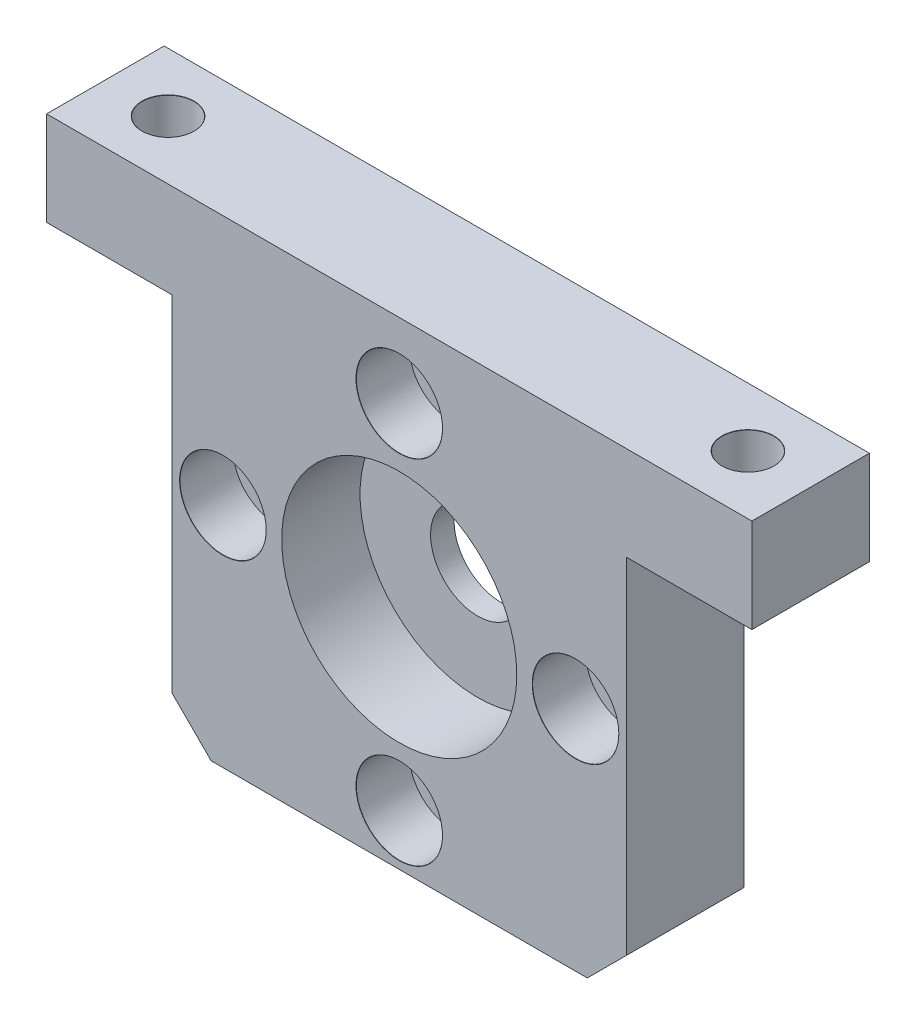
ISO-10303-21;
HEADER;
FILE_DESCRIPTION(('STEP AP214'),'2;1');
FILE_NAME('part.step','',(''),(''),'','','');
FILE_SCHEMA(('AUTOMOTIVE_DESIGN { 1 0 10303 214 1 1 1 1 }'));
ENDSEC;
DATA;
#1=APPLICATION_CONTEXT('core data for automotive mechanical design processes');
#2=APPLICATION_PROTOCOL_DEFINITION('international standard','automotive_design',2000,#1);
#3=PRODUCT_CONTEXT('',#1,'mechanical');
#4=PRODUCT('Part','Part','',(#3));
#5=PRODUCT_RELATED_PRODUCT_CATEGORY('part','',(#4));
#6=PRODUCT_DEFINITION_FORMATION('','',#4);
#7=PRODUCT_DEFINITION_CONTEXT('part definition',#1,'design');
#8=PRODUCT_DEFINITION('design','',#6,#7);
#9=PRODUCT_DEFINITION_SHAPE('','',#8);
#10=(LENGTH_UNIT() NAMED_UNIT(*) SI_UNIT(.MILLI.,.METRE.));
#11=(NAMED_UNIT(*) PLANE_ANGLE_UNIT() SI_UNIT($,.RADIAN.));
#12=(NAMED_UNIT(*) SI_UNIT($,.STERADIAN.) SOLID_ANGLE_UNIT());
#13=UNCERTAINTY_MEASURE_WITH_UNIT(LENGTH_MEASURE(1.E-05),#10,'distance_accuracy_value','');
#14=(GEOMETRIC_REPRESENTATION_CONTEXT(3) GLOBAL_UNCERTAINTY_ASSIGNED_CONTEXT((#13)) GLOBAL_UNIT_ASSIGNED_CONTEXT((#10,
#11,#12)) REPRESENTATION_CONTEXT('',''));
#15=CARTESIAN_POINT('',(0.,0.,0.));
#16=DIRECTION('',(0.,0.,1.));
#17=DIRECTION('',(1.,0.,0.));
#18=AXIS2_PLACEMENT_3D('',#15,#16,#17);
#19=CARTESIAN_POINT('',(-27.5119279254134,-20.6542028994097,0.));
#20=DIRECTION('',(0.,0.,1.));
#21=DIRECTION('',(1.,0.,0.));
#22=AXIS2_PLACEMENT_3D('',#19,#20,#21);
#23=CYLINDRICAL_SURFACE('',#22,6.);
#24=CARTESIAN_POINT('',(-27.5119279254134,-20.6542028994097,5.));
#25=DIRECTION('',(0.,0.,1.));
#26=DIRECTION('',(1.,0.,0.));
#27=AXIS2_PLACEMENT_3D('',#24,#25,#26);
#28=CIRCLE('',#27,6.);
#29=CARTESIAN_POINT('',(-21.5119279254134,-20.6542028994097,5.));
#30=VERTEX_POINT('',#29);
#31=EDGE_CURVE('E254',#30,#30,#28,.T.);
#32=ORIENTED_EDGE('',*,*,#31,.T.);
#33=EDGE_LOOP('',(#32));
#34=FACE_BOUND('',#33,.T.);
#35=CARTESIAN_POINT('',(-27.5119279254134,-20.6542028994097,2.));
#36=DIRECTION('',(0.,0.,-1.));
#37=DIRECTION('',(-1.,0.,0.));
#38=AXIS2_PLACEMENT_3D('',#35,#36,#37);
#39=CIRCLE('',#38,6.);
#40=CARTESIAN_POINT('',(-33.5119279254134,-20.6542028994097,2.));
#41=VERTEX_POINT('',#40);
#42=EDGE_CURVE('E251',#41,#41,#39,.F.);
#43=ORIENTED_EDGE('',*,*,#42,.F.);
#44=EDGE_LOOP('',(#43));
#45=FACE_BOUND('',#44,.T.);
#46=ADVANCED_FACE('F16',(#34,#45),#23,.F.);
#47=CARTESIAN_POINT('',(-72.5119279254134,11.3457971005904,15.));
#48=DIRECTION('',(1.,0.,0.));
#49=DIRECTION('',(0.,0.,-1.));
#50=AXIS2_PLACEMENT_3D('',#47,#48,#49);
#51=PLANE('',#50);
#52=DIRECTION('',(0.,-1.,0.));
#53=VECTOR('',#52,1.);
#54=CARTESIAN_POINT('',(-72.5119279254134,11.3457971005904,0.));
#55=LINE('',#54,#53);
#56=CARTESIAN_POINT('',(-72.5119279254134,11.3457971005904,0.));
#57=VERTEX_POINT('',#56);
#58=CARTESIAN_POINT('',(-72.5119279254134,-0.654202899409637,0.));
#59=VERTEX_POINT('',#58);
#60=EDGE_CURVE('E261',#57,#59,#55,.T.);
#61=ORIENTED_EDGE('',*,*,#60,.T.);
#62=DIRECTION('',(0.,0.,-1.));
#63=VECTOR('',#62,1.);
#64=CARTESIAN_POINT('',(-72.5119279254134,-0.654202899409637,15.));
#65=LINE('',#64,#63);
#66=CARTESIAN_POINT('',(-72.5119279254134,-0.654202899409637,15.));
#67=VERTEX_POINT('',#66);
#68=EDGE_CURVE('E313',#67,#59,#65,.T.);
#69=ORIENTED_EDGE('',*,*,#68,.F.);
#70=DIRECTION('',(0.,-1.,0.));
#71=VECTOR('',#70,1.);
#72=CARTESIAN_POINT('',(-72.5119279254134,11.3457971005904,15.));
#73=LINE('',#72,#71);
#74=CARTESIAN_POINT('',(-72.5119279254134,11.3457971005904,15.));
#75=VERTEX_POINT('',#74);
#76=EDGE_CURVE('E264',#75,#67,#73,.T.);
#77=ORIENTED_EDGE('',*,*,#76,.F.);
#78=DIRECTION('',(0.,0.,-1.));
#79=VECTOR('',#78,1.);
#80=CARTESIAN_POINT('',(-72.5119279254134,11.3457971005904,15.));
#81=LINE('',#80,#79);
#82=EDGE_CURVE('E282',#75,#57,#81,.T.);
#83=ORIENTED_EDGE('',*,*,#82,.T.);
#84=EDGE_LOOP('',(#61,#69,#77,#83));
#85=FACE_BOUND('',#84,.T.);
#86=ADVANCED_FACE('F350',(#85),#51,.F.);
#87=CARTESIAN_POINT('',(-72.5119279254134,-0.654202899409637,15.));
#88=DIRECTION('',(0.,1.,0.));
#89=DIRECTION('',(0.,0.,1.));
#90=AXIS2_PLACEMENT_3D('',#87,#88,#89);
#91=PLANE('',#90);
#92=CARTESIAN_POINT('',(-64.5119279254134,-0.654202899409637,7.5));
#93=DIRECTION('',(0.,-1.,0.));
#94=DIRECTION('',(0.,0.,-1.));
#95=AXIS2_PLACEMENT_3D('',#92,#93,#94);
#96=CIRCLE('',#95,5.525);
#97=CARTESIAN_POINT('',(-64.5119279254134,-0.654202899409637,1.975));
#98=VERTEX_POINT('',#97);
#99=EDGE_CURVE('E145',#98,#98,#96,.T.);
#100=ORIENTED_EDGE('',*,*,#99,.F.);
#101=EDGE_LOOP('',(#100));
#102=FACE_BOUND('',#101,.T.);
#103=DIRECTION('',(1.,0.,0.));
#104=VECTOR('',#103,1.);
#105=CARTESIAN_POINT('',(-72.5119279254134,-0.654202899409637,0.));
#106=LINE('',#105,#104);
#107=CARTESIAN_POINT('',(-56.5119279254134,-0.654202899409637,0.));
#108=VERTEX_POINT('',#107);
#109=EDGE_CURVE('E285',#59,#108,#106,.T.);
#110=ORIENTED_EDGE('',*,*,#109,.T.);
#111=DIRECTION('',(0.,0.,-1.));
#112=VECTOR('',#111,1.);
#113=CARTESIAN_POINT('',(-56.5119279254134,-0.654202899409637,15.));
#114=LINE('',#113,#112);
#115=CARTESIAN_POINT('',(-56.5119279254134,-0.654202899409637,15.));
#116=VERTEX_POINT('',#115);
#117=EDGE_CURVE('E310',#116,#108,#114,.T.);
#118=ORIENTED_EDGE('',*,*,#117,.F.);
#119=DIRECTION('',(1.,0.,0.));
#120=VECTOR('',#119,1.);
#121=CARTESIAN_POINT('',(-72.5119279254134,-0.654202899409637,15.));
#122=LINE('',#121,#120);
#123=EDGE_CURVE('E267',#67,#116,#122,.T.);
#124=ORIENTED_EDGE('',*,*,#123,.F.);
#125=ORIENTED_EDGE('',*,*,#68,.T.);
#126=EDGE_LOOP('',(#110,#118,#124,#125));
#127=FACE_BOUND('',#126,.T.);
#128=ADVANCED_FACE('F344',(#102,#127),#91,.F.);
#129=CARTESIAN_POINT('',(-56.5119279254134,-0.654202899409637,15.));
#130=DIRECTION('',(1.,0.,0.));
#131=DIRECTION('',(0.,1.,0.));
#132=AXIS2_PLACEMENT_3D('',#129,#130,#131);
#133=PLANE('',#132);
#134=CARTESIAN_POINT('',(-56.5119279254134,-29.6542028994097,7.5));
#135=DIRECTION('',(-1.,0.,0.));
#136=DIRECTION('',(0.,0.,1.));
#137=AXIS2_PLACEMENT_3D('',#134,#135,#136);
#138=CIRCLE('',#137,1.24999999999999);
#139=CARTESIAN_POINT('',(-56.5119279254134,-29.6542028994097,8.74999999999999));
#140=VERTEX_POINT('',#139);
#141=EDGE_CURVE('E111',#140,#140,#138,.T.);
#142=ORIENTED_EDGE('',*,*,#141,.F.);
#143=EDGE_LOOP('',(#142));
#144=FACE_BOUND('',#143,.T.);
#145=CARTESIAN_POINT('',(-56.5119279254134,-13.6542028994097,7.5));
#146=DIRECTION('',(-1.,0.,0.));
#147=DIRECTION('',(0.,0.,1.));
#148=AXIS2_PLACEMENT_3D('',#145,#146,#147);
#149=CIRCLE('',#148,1.25);
#150=CARTESIAN_POINT('',(-56.5119279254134,-13.6542028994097,8.75));
#151=VERTEX_POINT('',#150);
#152=EDGE_CURVE('E110',#151,#151,#149,.T.);
#153=ORIENTED_EDGE('',*,*,#152,.F.);
#154=EDGE_LOOP('',(#153));
#155=FACE_BOUND('',#154,.T.);
#156=DIRECTION('',(0.,-1.,0.));
#157=VECTOR('',#156,1.);
#158=CARTESIAN_POINT('',(-56.5119279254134,-0.654202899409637,0.));
#159=LINE('',#158,#157);
#160=CARTESIAN_POINT('',(-56.5119279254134,-44.6542028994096,0.));
#161=VERTEX_POINT('',#160);
#162=EDGE_CURVE('E287',#108,#161,#159,.T.);
#163=ORIENTED_EDGE('',*,*,#162,.T.);
#164=DIRECTION('',(0.,0.,1.));
#165=VECTOR('',#164,1.);
#166=CARTESIAN_POINT('',(-56.5119279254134,-44.6542028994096,15.));
#167=LINE('',#166,#165);
#168=CARTESIAN_POINT('',(-56.5119279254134,-44.6542028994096,15.));
#169=VERTEX_POINT('',#168);
#170=EDGE_CURVE('E39',#161,#169,#167,.T.);
#171=ORIENTED_EDGE('',*,*,#170,.T.);
#172=DIRECTION('',(0.,-1.,0.));
#173=VECTOR('',#172,1.);
#174=CARTESIAN_POINT('',(-56.5119279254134,-0.654202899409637,15.));
#175=LINE('',#174,#173);
#176=EDGE_CURVE('E270',#116,#169,#175,.T.);
#177=ORIENTED_EDGE('',*,*,#176,.F.);
#178=ORIENTED_EDGE('',*,*,#117,.T.);
#179=EDGE_LOOP('',(#163,#171,#177,#178));
#180=FACE_BOUND('',#179,.T.);
#181=ADVANCED_FACE('F341',(#144,#155,#180),#133,.F.);
#182=CARTESIAN_POINT('',(-56.5119279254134,-49.6542028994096,15.));
#183=DIRECTION('',(0.,1.,0.));
#184=DIRECTION('',(0.,0.,1.));
#185=AXIS2_PLACEMENT_3D('',#182,#183,#184);
#186=PLANE('',#185);
#187=DIRECTION('',(1.,0.,0.));
#188=VECTOR('',#187,1.);
#189=CARTESIAN_POINT('',(-56.5119279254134,-49.6542028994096,15.));
#190=LINE('',#189,#188);
#191=CARTESIAN_POINT('',(-51.5119279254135,-49.6542028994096,15.));
#192=VERTEX_POINT('',#191);
#193=CARTESIAN_POINT('',(-3.51192792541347,-49.6542028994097,15.));
#194=VERTEX_POINT('',#193);
#195=EDGE_CURVE('E272',#192,#194,#190,.T.);
#196=ORIENTED_EDGE('',*,*,#195,.F.);
#197=DIRECTION('',(0.,0.,-1.));
#198=VECTOR('',#197,1.);
#199=CARTESIAN_POINT('',(-51.5119279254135,-49.6542028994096,15.));
#200=LINE('',#199,#198);
#201=CARTESIAN_POINT('',(-51.5119279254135,-49.6542028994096,0.));
#202=VERTEX_POINT('',#201);
#203=EDGE_CURVE('E320',#192,#202,#200,.T.);
#204=ORIENTED_EDGE('',*,*,#203,.T.);
#205=DIRECTION('',(1.,0.,0.));
#206=VECTOR('',#205,1.);
#207=CARTESIAN_POINT('',(-56.5119279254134,-49.6542028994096,0.));
#208=LINE('',#207,#206);
#209=CARTESIAN_POINT('',(-3.51192792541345,-49.6542028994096,0.));
#210=VERTEX_POINT('',#209);
#211=EDGE_CURVE('E289',#202,#210,#208,.T.);
#212=ORIENTED_EDGE('',*,*,#211,.T.);
#213=DIRECTION('',(0.,0.,1.));
#214=VECTOR('',#213,1.);
#215=CARTESIAN_POINT('',(-3.51192792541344,-49.6542028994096,15.));
#216=LINE('',#215,#214);
#217=EDGE_CURVE('E316',#210,#194,#216,.T.);
#218=ORIENTED_EDGE('',*,*,#217,.T.);
#219=EDGE_LOOP('',(#196,#204,#212,#218));
#220=FACE_BOUND('',#219,.T.);
#221=ADVANCED_FACE('F334',(#220),#186,.F.);
#222=CARTESIAN_POINT('',(1.48807207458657,-0.654202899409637,15.));
#223=DIRECTION('',(-1.,0.,0.));
#224=DIRECTION('',(0.,-1.,0.));
#225=AXIS2_PLACEMENT_3D('',#222,#223,#224);
#226=PLANE('',#225);
#227=DIRECTION('',(0.,1.,0.));
#228=VECTOR('',#227,1.);
#229=CARTESIAN_POINT('',(1.48807207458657,-0.654202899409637,15.));
#230=LINE('',#229,#228);
#231=CARTESIAN_POINT('',(1.48807207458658,-44.6542028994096,15.));
#232=VERTEX_POINT('',#231);
#233=CARTESIAN_POINT('',(1.48807207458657,-0.654202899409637,15.));
#234=VERTEX_POINT('',#233);
#235=EDGE_CURVE('E274',#232,#234,#230,.T.);
#236=ORIENTED_EDGE('',*,*,#235,.F.);
#237=DIRECTION('',(0.,0.,-1.));
#238=VECTOR('',#237,1.);
#239=CARTESIAN_POINT('',(1.48807207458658,-44.6542028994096,15.));
#240=LINE('',#239,#238);
#241=CARTESIAN_POINT('',(1.48807207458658,-44.6542028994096,0.));
#242=VERTEX_POINT('',#241);
#243=EDGE_CURVE('E11',#232,#242,#240,.T.);
#244=ORIENTED_EDGE('',*,*,#243,.T.);
#245=DIRECTION('',(0.,1.,0.));
#246=VECTOR('',#245,1.);
#247=CARTESIAN_POINT('',(1.48807207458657,-0.654202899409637,0.));
#248=LINE('',#247,#246);
#249=CARTESIAN_POINT('',(1.48807207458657,-0.654202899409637,0.));
#250=VERTEX_POINT('',#249);
#251=EDGE_CURVE('E292',#242,#250,#248,.T.);
#252=ORIENTED_EDGE('',*,*,#251,.T.);
#253=DIRECTION('',(0.,0.,-1.));
#254=VECTOR('',#253,1.);
#255=CARTESIAN_POINT('',(1.48807207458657,-0.654202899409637,15.));
#256=LINE('',#255,#254);
#257=EDGE_CURVE('E307',#234,#250,#256,.T.);
#258=ORIENTED_EDGE('',*,*,#257,.F.);
#259=EDGE_LOOP('',(#236,#244,#252,#258));
#260=FACE_BOUND('',#259,.T.);
#261=ADVANCED_FACE('F368',(#260),#226,.F.);
#262=CARTESIAN_POINT('',(1.48807207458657,-0.654202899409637,15.));
#263=DIRECTION('',(0.,1.,0.));
#264=DIRECTION('',(0.,0.,1.));
#265=AXIS2_PLACEMENT_3D('',#262,#263,#264);
#266=PLANE('',#265);
#267=CARTESIAN_POINT('',(9.48807207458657,-0.654202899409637,7.5));
#268=DIRECTION('',(0.,-1.,0.));
#269=DIRECTION('',(0.,0.,-1.));
#270=AXIS2_PLACEMENT_3D('',#267,#268,#269);
#271=CIRCLE('',#270,5.525);
#272=CARTESIAN_POINT('',(9.48807207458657,-0.654202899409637,1.975));
#273=VERTEX_POINT('',#272);
#274=EDGE_CURVE('E124',#273,#273,#271,.T.);
#275=ORIENTED_EDGE('',*,*,#274,.F.);
#276=EDGE_LOOP('',(#275));
#277=FACE_BOUND('',#276,.T.);
#278=DIRECTION('',(1.,0.,0.));
#279=VECTOR('',#278,1.);
#280=CARTESIAN_POINT('',(1.48807207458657,-0.654202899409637,0.));
#281=LINE('',#280,#279);
#282=CARTESIAN_POINT('',(17.4880720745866,-0.654202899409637,0.));
#283=VERTEX_POINT('',#282);
#284=EDGE_CURVE('E294',#250,#283,#281,.T.);
#285=ORIENTED_EDGE('',*,*,#284,.T.);
#286=DIRECTION('',(0.,0.,-1.));
#287=VECTOR('',#286,1.);
#288=CARTESIAN_POINT('',(17.4880720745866,-0.654202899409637,15.));
#289=LINE('',#288,#287);
#290=CARTESIAN_POINT('',(17.4880720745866,-0.654202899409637,15.));
#291=VERTEX_POINT('',#290);
#292=EDGE_CURVE('E304',#291,#283,#289,.T.);
#293=ORIENTED_EDGE('',*,*,#292,.F.);
#294=DIRECTION('',(1.,0.,0.));
#295=VECTOR('',#294,1.);
#296=CARTESIAN_POINT('',(1.48807207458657,-0.654202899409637,15.));
#297=LINE('',#296,#295);
#298=EDGE_CURVE('E276',#234,#291,#297,.T.);
#299=ORIENTED_EDGE('',*,*,#298,.F.);
#300=ORIENTED_EDGE('',*,*,#257,.T.);
#301=EDGE_LOOP('',(#285,#293,#299,#300));
#302=FACE_BOUND('',#301,.T.);
#303=ADVANCED_FACE('F364',(#277,#302),#266,.F.);
#304=CARTESIAN_POINT('',(17.4880720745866,11.3457971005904,15.));
#305=DIRECTION('',(-1.,0.,0.));
#306=DIRECTION('',(0.,-1.,0.));
#307=AXIS2_PLACEMENT_3D('',#304,#305,#306);
#308=PLANE('',#307);
#309=DIRECTION('',(0.,1.,0.));
#310=VECTOR('',#309,1.);
#311=CARTESIAN_POINT('',(17.4880720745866,11.3457971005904,0.));
#312=LINE('',#311,#310);
#313=CARTESIAN_POINT('',(17.4880720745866,11.3457971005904,0.));
#314=VERTEX_POINT('',#313);
#315=EDGE_CURVE('E296',#283,#314,#312,.T.);
#316=ORIENTED_EDGE('',*,*,#315,.T.);
#317=DIRECTION('',(0.,0.,-1.));
#318=VECTOR('',#317,1.);
#319=CARTESIAN_POINT('',(17.4880720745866,11.3457971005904,15.));
#320=LINE('',#319,#318);
#321=CARTESIAN_POINT('',(17.4880720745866,11.3457971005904,15.));
#322=VERTEX_POINT('',#321);
#323=EDGE_CURVE('E301',#322,#314,#320,.T.);
#324=ORIENTED_EDGE('',*,*,#323,.F.);
#325=DIRECTION('',(0.,1.,0.));
#326=VECTOR('',#325,1.);
#327=CARTESIAN_POINT('',(17.4880720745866,11.3457971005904,15.));
#328=LINE('',#327,#326);
#329=EDGE_CURVE('E278',#291,#322,#328,.T.);
#330=ORIENTED_EDGE('',*,*,#329,.F.);
#331=ORIENTED_EDGE('',*,*,#292,.T.);
#332=EDGE_LOOP('',(#316,#324,#330,#331));
#333=FACE_BOUND('',#332,.T.);
#334=ADVANCED_FACE('F359',(#333),#308,.F.);
#335=CARTESIAN_POINT('',(-72.5119279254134,11.3457971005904,15.));
#336=DIRECTION('',(0.,-1.,0.));
#337=DIRECTION('',(0.,0.,-1.));
#338=AXIS2_PLACEMENT_3D('',#335,#336,#337);
#339=PLANE('',#338);
#340=CARTESIAN_POINT('',(9.48807207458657,11.3457971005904,7.5));
#341=DIRECTION('',(0.,-1.,0.));
#342=DIRECTION('',(0.,0.,-1.));
#343=AXIS2_PLACEMENT_3D('',#340,#341,#342);
#344=CIRCLE('',#343,3.325);
#345=CARTESIAN_POINT('',(9.48807207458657,11.3457971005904,4.175));
#346=VERTEX_POINT('',#345);
#347=EDGE_CURVE('E121',#346,#346,#344,.T.);
#348=ORIENTED_EDGE('',*,*,#347,.T.);
#349=EDGE_LOOP('',(#348));
#350=FACE_BOUND('',#349,.T.);
#351=CARTESIAN_POINT('',(-64.5119279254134,11.3457971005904,7.5));
#352=DIRECTION('',(0.,-1.,0.));
#353=DIRECTION('',(0.,0.,-1.));
#354=AXIS2_PLACEMENT_3D('',#351,#352,#353);
#355=CIRCLE('',#354,3.325);
#356=CARTESIAN_POINT('',(-64.5119279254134,11.3457971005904,4.175));
#357=VERTEX_POINT('',#356);
#358=EDGE_CURVE('E142',#357,#357,#355,.T.);
#359=ORIENTED_EDGE('',*,*,#358,.T.);
#360=EDGE_LOOP('',(#359));
#361=FACE_BOUND('',#360,.T.);
#362=DIRECTION('',(-1.,0.,0.));
#363=VECTOR('',#362,1.);
#364=CARTESIAN_POINT('',(-72.5119279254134,11.3457971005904,0.));
#365=LINE('',#364,#363);
#366=EDGE_CURVE('E268',#314,#57,#365,.T.);
#367=ORIENTED_EDGE('',*,*,#366,.T.);
#368=ORIENTED_EDGE('',*,*,#82,.F.);
#369=DIRECTION('',(-1.,0.,0.));
#370=VECTOR('',#369,1.);
#371=CARTESIAN_POINT('',(-72.5119279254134,11.3457971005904,15.));
#372=LINE('',#371,#370);
#373=EDGE_CURVE('E280',#322,#75,#372,.T.);
#374=ORIENTED_EDGE('',*,*,#373,.F.);
#375=ORIENTED_EDGE('',*,*,#323,.T.);
#376=EDGE_LOOP('',(#367,#368,#374,#375));
#377=FACE_BOUND('',#376,.T.);
#378=ADVANCED_FACE('F355',(#350,#361,#377),#339,.F.);
#379=CARTESIAN_POINT('',(0.,0.,15.));
#380=DIRECTION('',(0.,0.,1.));
#381=DIRECTION('',(1.,0.,0.));
#382=AXIS2_PLACEMENT_3D('',#379,#380,#381);
#383=PLANE('',#382);
#384=CARTESIAN_POINT('',(-27.5119279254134,-43.1542028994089,15.));
#385=DIRECTION('',(0.,0.,1.));
#386=DIRECTION('',(1.,0.,0.));
#387=AXIS2_PLACEMENT_3D('',#384,#385,#386);
#388=CIRCLE('',#387,5.525);
#389=CARTESIAN_POINT('',(-21.9869279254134,-43.1542028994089,15.));
#390=VERTEX_POINT('',#389);
#391=EDGE_CURVE('E166',#390,#390,#388,.T.);
#392=ORIENTED_EDGE('',*,*,#391,.F.);
#393=EDGE_LOOP('',(#392));
#394=FACE_BOUND('',#393,.T.);
#395=CARTESIAN_POINT('',(-50.0119279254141,-20.6542028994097,15.));
#396=DIRECTION('',(0.,0.,1.));
#397=DIRECTION('',(1.,0.,0.));
#398=AXIS2_PLACEMENT_3D('',#395,#396,#397);
#399=CIRCLE('',#398,5.525);
#400=CARTESIAN_POINT('',(-44.4869279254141,-20.6542028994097,15.));
#401=VERTEX_POINT('',#400);
#402=EDGE_CURVE('E187',#401,#401,#399,.T.);
#403=ORIENTED_EDGE('',*,*,#402,.F.);
#404=EDGE_LOOP('',(#403));
#405=FACE_BOUND('',#404,.T.);
#406=CARTESIAN_POINT('',(-27.5119279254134,1.84579710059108,15.));
#407=DIRECTION('',(0.,0.,1.));
#408=DIRECTION('',(1.,0.,0.));
#409=AXIS2_PLACEMENT_3D('',#406,#407,#408);
#410=CIRCLE('',#409,5.525);
#411=CARTESIAN_POINT('',(-21.9869279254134,1.84579710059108,15.));
#412=VERTEX_POINT('',#411);
#413=EDGE_CURVE('E208',#412,#412,#410,.T.);
#414=ORIENTED_EDGE('',*,*,#413,.F.);
#415=EDGE_LOOP('',(#414));
#416=FACE_BOUND('',#415,.T.);
#417=CARTESIAN_POINT('',(-5.01192792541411,-20.6542028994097,15.));
#418=DIRECTION('',(0.,0.,1.));
#419=DIRECTION('',(1.,0.,0.));
#420=AXIS2_PLACEMENT_3D('',#417,#418,#419);
#421=CIRCLE('',#420,5.525);
#422=CARTESIAN_POINT('',(0.51307207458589,-20.6542028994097,15.));
#423=VERTEX_POINT('',#422);
#424=EDGE_CURVE('E229',#423,#423,#421,.T.);
#425=ORIENTED_EDGE('',*,*,#424,.F.);
#426=EDGE_LOOP('',(#425));
#427=FACE_BOUND('',#426,.T.);
#428=CARTESIAN_POINT('',(-27.5119279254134,-20.6542028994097,15.));
#429=DIRECTION('',(0.,0.,1.));
#430=DIRECTION('',(1.,0.,0.));
#431=AXIS2_PLACEMENT_3D('',#428,#429,#430);
#432=CIRCLE('',#431,15.);
#433=CARTESIAN_POINT('',(-12.5119279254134,-20.6542028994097,15.));
#434=VERTEX_POINT('',#433);
#435=EDGE_CURVE('E257',#434,#434,#432,.T.);
#436=ORIENTED_EDGE('',*,*,#435,.F.);
#437=EDGE_LOOP('',(#436));
#438=FACE_BOUND('',#437,.T.);
#439=ORIENTED_EDGE('',*,*,#176,.T.);
#440=DIRECTION('',(-0.707106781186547,0.707106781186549,0.));
#441=VECTOR('',#440,1.);
#442=CARTESIAN_POINT('',(-50.5830654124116,-50.5830654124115,15.));
#443=LINE('',#442,#441);
#444=EDGE_CURVE('E24',#169,#192,#443,.F.);
#445=ORIENTED_EDGE('',*,*,#444,.T.);
#446=ORIENTED_EDGE('',*,*,#195,.T.);
#447=DIRECTION('',(-0.70710678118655,-0.707106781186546,0.));
#448=VECTOR('',#447,1.);
#449=CARTESIAN_POINT('',(23.0711374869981,-23.0711374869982,15.));
#450=LINE('',#449,#448);
#451=EDGE_CURVE('E31',#194,#232,#450,.F.);
#452=ORIENTED_EDGE('',*,*,#451,.T.);
#453=ORIENTED_EDGE('',*,*,#235,.T.);
#454=ORIENTED_EDGE('',*,*,#298,.T.);
#455=ORIENTED_EDGE('',*,*,#329,.T.);
#456=ORIENTED_EDGE('',*,*,#373,.T.);
#457=ORIENTED_EDGE('',*,*,#76,.T.);
#458=ORIENTED_EDGE('',*,*,#123,.T.);
#459=EDGE_LOOP('',(#439,#445,#446,#452,#453,#454,#455,#456,#457,#458));
#460=FACE_BOUND('',#459,.T.);
#461=ADVANCED_FACE('F330',(#394,#405,#416,#427,#438,#460),#383,.T.);
#462=CARTESIAN_POINT('',(0.,0.,0.));
#463=DIRECTION('',(0.,0.,1.));
#464=DIRECTION('',(1.,0.,0.));
#465=AXIS2_PLACEMENT_3D('',#462,#463,#464);
#466=PLANE('',#465);
#467=CARTESIAN_POINT('',(-27.5119279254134,-20.6542028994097,0.));
#468=DIRECTION('',(0.,0.,-1.));
#469=DIRECTION('',(-1.,0.,0.));
#470=AXIS2_PLACEMENT_3D('',#467,#468,#469);
#471=CIRCLE('',#470,27.5);
#472=CARTESIAN_POINT('',(-55.0119279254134,-20.6542028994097,0.));
#473=VERTEX_POINT('',#472);
#474=EDGE_CURVE('E247',#473,#473,#471,.T.);
#475=ORIENTED_EDGE('',*,*,#474,.F.);
#476=EDGE_LOOP('',(#475));
#477=FACE_BOUND('',#476,.T.);
#478=ORIENTED_EDGE('',*,*,#211,.F.);
#479=DIRECTION('',(0.707106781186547,-0.707106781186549,0.));
#480=VECTOR('',#479,1.);
#481=CARTESIAN_POINT('',(-51.5119279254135,-49.6542028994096,0.));
#482=LINE('',#481,#480);
#483=EDGE_CURVE('E325',#202,#161,#482,.F.);
#484=ORIENTED_EDGE('',*,*,#483,.T.);
#485=ORIENTED_EDGE('',*,*,#162,.F.);
#486=ORIENTED_EDGE('',*,*,#109,.F.);
#487=ORIENTED_EDGE('',*,*,#60,.F.);
#488=ORIENTED_EDGE('',*,*,#366,.F.);
#489=ORIENTED_EDGE('',*,*,#315,.F.);
#490=ORIENTED_EDGE('',*,*,#284,.F.);
#491=ORIENTED_EDGE('',*,*,#251,.F.);
#492=DIRECTION('',(0.70710678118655,0.707106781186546,0.));
#493=VECTOR('',#492,1.);
#494=CARTESIAN_POINT('',(1.48807207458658,-44.6542028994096,0.));
#495=LINE('',#494,#493);
#496=EDGE_CURVE('E323',#242,#210,#495,.F.);
#497=ORIENTED_EDGE('',*,*,#496,.T.);
#498=EDGE_LOOP('',(#478,#484,#485,#486,#487,#488,#489,#490,#491,#497));
#499=FACE_BOUND('',#498,.T.);
#500=ADVANCED_FACE('F340',(#477,#499),#466,.F.);
#501=CARTESIAN_POINT('',(-27.5119279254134,-20.6542028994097,5.));
#502=DIRECTION('',(0.,0.,1.));
#503=DIRECTION('',(1.,0.,0.));
#504=AXIS2_PLACEMENT_3D('',#501,#502,#503);
#505=CYLINDRICAL_SURFACE('',#504,15.);
#506=CARTESIAN_POINT('',(-27.5119279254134,-20.6542028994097,5.));
#507=DIRECTION('',(0.,0.,1.));
#508=DIRECTION('',(1.,0.,0.));
#509=AXIS2_PLACEMENT_3D('',#506,#507,#508);
#510=CIRCLE('',#509,15.);
#511=CARTESIAN_POINT('',(-12.5119279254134,-20.6542028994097,5.));
#512=VERTEX_POINT('',#511);
#513=EDGE_CURVE('E258',#512,#512,#510,.T.);
#514=ORIENTED_EDGE('',*,*,#513,.F.);
#515=EDGE_LOOP('',(#514));
#516=FACE_BOUND('',#515,.T.);
#517=ORIENTED_EDGE('',*,*,#435,.T.);
#518=EDGE_LOOP('',(#517));
#519=FACE_BOUND('',#518,.T.);
#520=ADVANCED_FACE('F399',(#516,#519),#505,.F.);
#521=CARTESIAN_POINT('',(-27.5119279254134,-20.6542028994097,5.));
#522=DIRECTION('',(0.,0.,1.));
#523=DIRECTION('',(1.,0.,0.));
#524=AXIS2_PLACEMENT_3D('',#521,#522,#523);
#525=PLANE('',#524);
#526=ORIENTED_EDGE('',*,*,#31,.F.);
#527=EDGE_LOOP('',(#526));
#528=FACE_BOUND('',#527,.T.);
#529=ORIENTED_EDGE('',*,*,#513,.T.);
#530=EDGE_LOOP('',(#529));
#531=FACE_BOUND('',#530,.T.);
#532=ADVANCED_FACE('F395',(#528,#531),#525,.T.);
#533=CARTESIAN_POINT('',(-27.5119279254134,-20.6542028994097,2.));
#534=DIRECTION('',(0.,0.,-1.));
#535=DIRECTION('',(-1.,0.,0.));
#536=AXIS2_PLACEMENT_3D('',#533,#534,#535);
#537=PLANE('',#536);
#538=CARTESIAN_POINT('',(-27.5119279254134,-43.1542028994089,2.));
#539=DIRECTION('',(0.,0.,1.));
#540=DIRECTION('',(1.,0.,0.));
#541=AXIS2_PLACEMENT_3D('',#538,#539,#540);
#542=CIRCLE('',#541,3.325);
#543=CARTESIAN_POINT('',(-24.1869279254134,-43.1542028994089,2.));
#544=VERTEX_POINT('',#543);
#545=EDGE_CURVE('E163',#544,#544,#542,.T.);
#546=ORIENTED_EDGE('',*,*,#545,.T.);
#547=EDGE_LOOP('',(#546));
#548=FACE_BOUND('',#547,.T.);
#549=CARTESIAN_POINT('',(-50.0119279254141,-20.6542028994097,2.));
#550=DIRECTION('',(0.,0.,1.));
#551=DIRECTION('',(1.,0.,0.));
#552=AXIS2_PLACEMENT_3D('',#549,#550,#551);
#553=CIRCLE('',#552,3.325);
#554=CARTESIAN_POINT('',(-46.6869279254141,-20.6542028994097,2.));
#555=VERTEX_POINT('',#554);
#556=EDGE_CURVE('E184',#555,#555,#553,.T.);
#557=ORIENTED_EDGE('',*,*,#556,.T.);
#558=EDGE_LOOP('',(#557));
#559=FACE_BOUND('',#558,.T.);
#560=CARTESIAN_POINT('',(-27.5119279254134,1.84579710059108,2.));
#561=DIRECTION('',(0.,0.,1.));
#562=DIRECTION('',(1.,0.,0.));
#563=AXIS2_PLACEMENT_3D('',#560,#561,#562);
#564=CIRCLE('',#563,3.325);
#565=CARTESIAN_POINT('',(-24.1869279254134,1.84579710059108,2.));
#566=VERTEX_POINT('',#565);
#567=EDGE_CURVE('E205',#566,#566,#564,.T.);
#568=ORIENTED_EDGE('',*,*,#567,.T.);
#569=EDGE_LOOP('',(#568));
#570=FACE_BOUND('',#569,.T.);
#571=CARTESIAN_POINT('',(-5.01192792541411,-20.6542028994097,2.));
#572=DIRECTION('',(0.,0.,1.));
#573=DIRECTION('',(1.,0.,0.));
#574=AXIS2_PLACEMENT_3D('',#571,#572,#573);
#575=CIRCLE('',#574,3.325);
#576=CARTESIAN_POINT('',(-1.68692792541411,-20.6542028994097,2.));
#577=VERTEX_POINT('',#576);
#578=EDGE_CURVE('E226',#577,#577,#575,.T.);
#579=ORIENTED_EDGE('',*,*,#578,.T.);
#580=EDGE_LOOP('',(#579));
#581=FACE_BOUND('',#580,.T.);
#582=CARTESIAN_POINT('',(-27.5119279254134,-20.6542028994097,2.));
#583=DIRECTION('',(0.,0.,-1.));
#584=DIRECTION('',(-1.,0.,0.));
#585=AXIS2_PLACEMENT_3D('',#582,#583,#584);
#586=CIRCLE('',#585,27.5);
#587=CARTESIAN_POINT('',(-55.0119279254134,-20.6542028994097,2.));
#588=VERTEX_POINT('',#587);
#589=EDGE_CURVE('E248',#588,#588,#586,.T.);
#590=ORIENTED_EDGE('',*,*,#589,.T.);
#591=EDGE_LOOP('',(#590));
#592=FACE_BOUND('',#591,.T.);
#593=ORIENTED_EDGE('',*,*,#42,.T.);
#594=EDGE_LOOP('',(#593));
#595=FACE_BOUND('',#594,.T.);
#596=ADVANCED_FACE('F398',(#548,#559,#570,#581,#592,#595),#537,.T.);
#597=CARTESIAN_POINT('',(-27.5119279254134,-20.6542028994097,2.));
#598=DIRECTION('',(0.,0.,-1.));
#599=DIRECTION('',(-1.,0.,0.));
#600=AXIS2_PLACEMENT_3D('',#597,#598,#599);
#601=CYLINDRICAL_SURFACE('',#600,27.5);
#602=ORIENTED_EDGE('',*,*,#589,.F.);
#603=EDGE_LOOP('',(#602));
#604=FACE_BOUND('',#603,.T.);
#605=ORIENTED_EDGE('',*,*,#474,.T.);
#606=EDGE_LOOP('',(#605));
#607=FACE_BOUND('',#606,.T.);
#608=ADVANCED_FACE('F393',(#604,#607),#601,.F.);
#609=CARTESIAN_POINT('',(-5.01192792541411,-20.6542028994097,2.025));
#610=DIRECTION('',(0.,0.,-1.));
#611=DIRECTION('',(-1.,0.,0.));
#612=AXIS2_PLACEMENT_3D('',#609,#610,#611);
#613=CONICAL_SURFACE('',#612,3.3,0.785398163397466);
#614=ORIENTED_EDGE('',*,*,#578,.F.);
#615=EDGE_LOOP('',(#614));
#616=FACE_BOUND('',#615,.T.);
#617=CARTESIAN_POINT('',(-5.01192792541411,-20.6542028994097,2.025));
#618=DIRECTION('',(0.,0.,1.));
#619=DIRECTION('',(1.,0.,0.));
#620=AXIS2_PLACEMENT_3D('',#617,#618,#619);
#621=CIRCLE('',#620,3.3);
#622=CARTESIAN_POINT('',(-1.71192792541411,-20.6542028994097,2.025));
#623=VERTEX_POINT('',#622);
#624=EDGE_CURVE('E244',#623,#623,#621,.T.);
#625=ORIENTED_EDGE('',*,*,#624,.T.);
#626=EDGE_LOOP('',(#625));
#627=FACE_BOUND('',#626,.T.);
#628=ADVANCED_FACE('F558',(#616,#627),#613,.F.);
#629=CARTESIAN_POINT('',(-5.01192792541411,-20.6542028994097,15.));
#630=DIRECTION('',(0.,0.,1.));
#631=DIRECTION('',(1.,0.,0.));
#632=AXIS2_PLACEMENT_3D('',#629,#630,#631);
#633=CYLINDRICAL_SURFACE('',#632,3.3);
#634=ORIENTED_EDGE('',*,*,#624,.F.);
#635=EDGE_LOOP('',(#634));
#636=FACE_BOUND('',#635,.T.);
#637=CARTESIAN_POINT('',(-5.01192792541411,-20.6542028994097,8.175));
#638=DIRECTION('',(0.,0.,1.));
#639=DIRECTION('',(1.,0.,0.));
#640=AXIS2_PLACEMENT_3D('',#637,#638,#639);
#641=CIRCLE('',#640,3.3);
#642=CARTESIAN_POINT('',(-1.71192792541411,-20.6542028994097,8.175));
#643=VERTEX_POINT('',#642);
#644=EDGE_CURVE('E241',#643,#643,#641,.T.);
#645=ORIENTED_EDGE('',*,*,#644,.T.);
#646=EDGE_LOOP('',(#645));
#647=FACE_BOUND('',#646,.T.);
#648=ADVANCED_FACE('F554',(#636,#647),#633,.F.);
#649=CARTESIAN_POINT('',(-5.01192792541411,-20.6542028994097,8.2));
#650=DIRECTION('',(0.,0.,1.));
#651=DIRECTION('',(1.,0.,0.));
#652=AXIS2_PLACEMENT_3D('',#649,#650,#651);
#653=CONICAL_SURFACE('',#652,3.325,0.785398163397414);
#654=ORIENTED_EDGE('',*,*,#644,.F.);
#655=EDGE_LOOP('',(#654));
#656=FACE_BOUND('',#655,.T.);
#657=CARTESIAN_POINT('',(-5.01192792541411,-20.6542028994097,8.2));
#658=DIRECTION('',(0.,0.,1.));
#659=DIRECTION('',(1.,0.,0.));
#660=AXIS2_PLACEMENT_3D('',#657,#658,#659);
#661=CIRCLE('',#660,3.325);
#662=CARTESIAN_POINT('',(-1.68692792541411,-20.6542028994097,8.2));
#663=VERTEX_POINT('',#662);
#664=EDGE_CURVE('E238',#663,#663,#661,.T.);
#665=ORIENTED_EDGE('',*,*,#664,.T.);
#666=EDGE_LOOP('',(#665));
#667=FACE_BOUND('',#666,.T.);
#668=ADVANCED_FACE('F550',(#656,#667),#653,.F.);
#669=CARTESIAN_POINT('',(-1.68692792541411,-20.6542028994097,8.2));
#670=DIRECTION('',(0.,0.,-1.));
#671=DIRECTION('',(-1.,0.,0.));
#672=AXIS2_PLACEMENT_3D('',#669,#670,#671);
#673=PLANE('',#672);
#674=ORIENTED_EDGE('',*,*,#664,.F.);
#675=EDGE_LOOP('',(#674));
#676=FACE_BOUND('',#675,.T.);
#677=CARTESIAN_POINT('',(-5.01192792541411,-20.6542028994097,8.2));
#678=DIRECTION('',(0.,0.,1.));
#679=DIRECTION('',(1.,0.,0.));
#680=AXIS2_PLACEMENT_3D('',#677,#678,#679);
#681=CIRCLE('',#680,5.5);
#682=CARTESIAN_POINT('',(0.48807207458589,-20.6542028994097,8.2));
#683=VERTEX_POINT('',#682);
#684=EDGE_CURVE('E235',#683,#683,#681,.T.);
#685=ORIENTED_EDGE('',*,*,#684,.T.);
#686=EDGE_LOOP('',(#685));
#687=FACE_BOUND('',#686,.T.);
#688=ADVANCED_FACE('F546',(#676,#687),#673,.F.);
#689=CARTESIAN_POINT('',(-5.01192792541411,-20.6542028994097,15.));
#690=DIRECTION('',(0.,0.,1.));
#691=DIRECTION('',(1.,0.,0.));
#692=AXIS2_PLACEMENT_3D('',#689,#690,#691);
#693=CYLINDRICAL_SURFACE('',#692,5.5);
#694=ORIENTED_EDGE('',*,*,#684,.F.);
#695=EDGE_LOOP('',(#694));
#696=FACE_BOUND('',#695,.T.);
#697=CARTESIAN_POINT('',(-5.01192792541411,-20.6542028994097,14.975));
#698=DIRECTION('',(0.,0.,1.));
#699=DIRECTION('',(1.,0.,0.));
#700=AXIS2_PLACEMENT_3D('',#697,#698,#699);
#701=CIRCLE('',#700,5.5);
#702=CARTESIAN_POINT('',(0.48807207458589,-20.6542028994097,14.975));
#703=VERTEX_POINT('',#702);
#704=EDGE_CURVE('E232',#703,#703,#701,.T.);
#705=ORIENTED_EDGE('',*,*,#704,.T.);
#706=EDGE_LOOP('',(#705));
#707=FACE_BOUND('',#706,.T.);
#708=ADVANCED_FACE('F542',(#696,#707),#693,.F.);
#709=CARTESIAN_POINT('',(-5.01192792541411,-20.6542028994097,15.));
#710=DIRECTION('',(0.,0.,1.));
#711=DIRECTION('',(1.,0.,0.));
#712=AXIS2_PLACEMENT_3D('',#709,#710,#711);
#713=CONICAL_SURFACE('',#712,5.525,0.785398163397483);
#714=ORIENTED_EDGE('',*,*,#704,.F.);
#715=EDGE_LOOP('',(#714));
#716=FACE_BOUND('',#715,.T.);
#717=ORIENTED_EDGE('',*,*,#424,.T.);
#718=EDGE_LOOP('',(#717));
#719=FACE_BOUND('',#718,.T.);
#720=ADVANCED_FACE('F538',(#716,#719),#713,.F.);
#721=CARTESIAN_POINT('',(-27.5119279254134,1.84579710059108,2.025));
#722=DIRECTION('',(0.,0.,-1.));
#723=DIRECTION('',(-1.,0.,0.));
#724=AXIS2_PLACEMENT_3D('',#721,#722,#723);
#725=CONICAL_SURFACE('',#724,3.3,0.785398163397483);
#726=ORIENTED_EDGE('',*,*,#567,.F.);
#727=EDGE_LOOP('',(#726));
#728=FACE_BOUND('',#727,.T.);
#729=CARTESIAN_POINT('',(-27.5119279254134,1.84579710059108,2.025));
#730=DIRECTION('',(0.,0.,1.));
#731=DIRECTION('',(1.,0.,0.));
#732=AXIS2_PLACEMENT_3D('',#729,#730,#731);
#733=CIRCLE('',#732,3.3);
#734=CARTESIAN_POINT('',(-24.2119279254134,1.84579710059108,2.025));
#735=VERTEX_POINT('',#734);
#736=EDGE_CURVE('E223',#735,#735,#733,.T.);
#737=ORIENTED_EDGE('',*,*,#736,.T.);
#738=EDGE_LOOP('',(#737));
#739=FACE_BOUND('',#738,.T.);
#740=ADVANCED_FACE('F534',(#728,#739),#725,.F.);
#741=CARTESIAN_POINT('',(-27.5119279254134,1.84579710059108,15.));
#742=DIRECTION('',(0.,0.,1.));
#743=DIRECTION('',(1.,0.,0.));
#744=AXIS2_PLACEMENT_3D('',#741,#742,#743);
#745=CYLINDRICAL_SURFACE('',#744,3.3);
#746=ORIENTED_EDGE('',*,*,#736,.F.);
#747=EDGE_LOOP('',(#746));
#748=FACE_BOUND('',#747,.T.);
#749=CARTESIAN_POINT('',(-27.5119279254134,1.84579710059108,8.175));
#750=DIRECTION('',(0.,0.,1.));
#751=DIRECTION('',(1.,0.,0.));
#752=AXIS2_PLACEMENT_3D('',#749,#750,#751);
#753=CIRCLE('',#752,3.3);
#754=CARTESIAN_POINT('',(-24.2119279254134,1.84579710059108,8.175));
#755=VERTEX_POINT('',#754);
#756=EDGE_CURVE('E220',#755,#755,#753,.T.);
#757=ORIENTED_EDGE('',*,*,#756,.T.);
#758=EDGE_LOOP('',(#757));
#759=FACE_BOUND('',#758,.T.);
#760=ADVANCED_FACE('F530',(#748,#759),#745,.F.);
#761=CARTESIAN_POINT('',(-27.5119279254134,1.84579710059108,8.2));
#762=DIRECTION('',(0.,0.,1.));
#763=DIRECTION('',(1.,0.,0.));
#764=AXIS2_PLACEMENT_3D('',#761,#762,#763);
#765=CONICAL_SURFACE('',#764,3.325,0.785398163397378);
#766=ORIENTED_EDGE('',*,*,#756,.F.);
#767=EDGE_LOOP('',(#766));
#768=FACE_BOUND('',#767,.T.);
#769=CARTESIAN_POINT('',(-27.5119279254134,1.84579710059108,8.2));
#770=DIRECTION('',(0.,0.,1.));
#771=DIRECTION('',(1.,0.,0.));
#772=AXIS2_PLACEMENT_3D('',#769,#770,#771);
#773=CIRCLE('',#772,3.325);
#774=CARTESIAN_POINT('',(-24.1869279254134,1.84579710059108,8.2));
#775=VERTEX_POINT('',#774);
#776=EDGE_CURVE('E217',#775,#775,#773,.T.);
#777=ORIENTED_EDGE('',*,*,#776,.T.);
#778=EDGE_LOOP('',(#777));
#779=FACE_BOUND('',#778,.T.);
#780=ADVANCED_FACE('F526',(#768,#779),#765,.F.);
#781=CARTESIAN_POINT('',(-24.1869279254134,1.84579710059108,8.2));
#782=DIRECTION('',(0.,0.,-1.));
#783=DIRECTION('',(-1.,0.,0.));
#784=AXIS2_PLACEMENT_3D('',#781,#782,#783);
#785=PLANE('',#784);
#786=ORIENTED_EDGE('',*,*,#776,.F.);
#787=EDGE_LOOP('',(#786));
#788=FACE_BOUND('',#787,.T.);
#789=CARTESIAN_POINT('',(-27.5119279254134,1.84579710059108,8.2));
#790=DIRECTION('',(0.,0.,1.));
#791=DIRECTION('',(1.,0.,0.));
#792=AXIS2_PLACEMENT_3D('',#789,#790,#791);
#793=CIRCLE('',#792,5.5);
#794=CARTESIAN_POINT('',(-22.0119279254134,1.84579710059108,8.2));
#795=VERTEX_POINT('',#794);
#796=EDGE_CURVE('E214',#795,#795,#793,.T.);
#797=ORIENTED_EDGE('',*,*,#796,.T.);
#798=EDGE_LOOP('',(#797));
#799=FACE_BOUND('',#798,.T.);
#800=ADVANCED_FACE('F522',(#788,#799),#785,.F.);
#801=CARTESIAN_POINT('',(-27.5119279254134,1.84579710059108,15.));
#802=DIRECTION('',(0.,0.,1.));
#803=DIRECTION('',(1.,0.,0.));
#804=AXIS2_PLACEMENT_3D('',#801,#802,#803);
#805=CYLINDRICAL_SURFACE('',#804,5.5);
#806=ORIENTED_EDGE('',*,*,#796,.F.);
#807=EDGE_LOOP('',(#806));
#808=FACE_BOUND('',#807,.T.);
#809=CARTESIAN_POINT('',(-27.5119279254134,1.84579710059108,14.975));
#810=DIRECTION('',(0.,0.,1.));
#811=DIRECTION('',(1.,0.,0.));
#812=AXIS2_PLACEMENT_3D('',#809,#810,#811);
#813=CIRCLE('',#812,5.5);
#814=CARTESIAN_POINT('',(-22.0119279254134,1.84579710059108,14.975));
#815=VERTEX_POINT('',#814);
#816=EDGE_CURVE('E211',#815,#815,#813,.T.);
#817=ORIENTED_EDGE('',*,*,#816,.T.);
#818=EDGE_LOOP('',(#817));
#819=FACE_BOUND('',#818,.T.);
#820=ADVANCED_FACE('F518',(#808,#819),#805,.F.);
#821=CARTESIAN_POINT('',(-27.5119279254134,1.84579710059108,15.));
#822=DIRECTION('',(0.,0.,1.));
#823=DIRECTION('',(1.,0.,0.));
#824=AXIS2_PLACEMENT_3D('',#821,#822,#823);
#825=CONICAL_SURFACE('',#824,5.525,0.785398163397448);
#826=ORIENTED_EDGE('',*,*,#816,.F.);
#827=EDGE_LOOP('',(#826));
#828=FACE_BOUND('',#827,.T.);
#829=ORIENTED_EDGE('',*,*,#413,.T.);
#830=EDGE_LOOP('',(#829));
#831=FACE_BOUND('',#830,.T.);
#832=ADVANCED_FACE('F514',(#828,#831),#825,.F.);
#833=CARTESIAN_POINT('',(-50.0119279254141,-20.6542028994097,2.025));
#834=DIRECTION('',(0.,0.,-1.));
#835=DIRECTION('',(-1.,0.,0.));
#836=AXIS2_PLACEMENT_3D('',#833,#834,#835);
#837=CONICAL_SURFACE('',#836,3.3,0.785398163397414);
#838=ORIENTED_EDGE('',*,*,#556,.F.);
#839=EDGE_LOOP('',(#838));
#840=FACE_BOUND('',#839,.T.);
#841=CARTESIAN_POINT('',(-50.0119279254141,-20.6542028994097,2.025));
#842=DIRECTION('',(0.,0.,1.));
#843=DIRECTION('',(1.,0.,0.));
#844=AXIS2_PLACEMENT_3D('',#841,#842,#843);
#845=CIRCLE('',#844,3.3);
#846=CARTESIAN_POINT('',(-46.7119279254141,-20.6542028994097,2.025));
#847=VERTEX_POINT('',#846);
#848=EDGE_CURVE('E202',#847,#847,#845,.T.);
#849=ORIENTED_EDGE('',*,*,#848,.T.);
#850=EDGE_LOOP('',(#849));
#851=FACE_BOUND('',#850,.T.);
#852=ADVANCED_FACE('F510',(#840,#851),#837,.F.);
#853=CARTESIAN_POINT('',(-50.0119279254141,-20.6542028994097,15.));
#854=DIRECTION('',(0.,0.,1.));
#855=DIRECTION('',(1.,0.,0.));
#856=AXIS2_PLACEMENT_3D('',#853,#854,#855);
#857=CYLINDRICAL_SURFACE('',#856,3.3);
#858=ORIENTED_EDGE('',*,*,#848,.F.);
#859=EDGE_LOOP('',(#858));
#860=FACE_BOUND('',#859,.T.);
#861=CARTESIAN_POINT('',(-50.0119279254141,-20.6542028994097,8.175));
#862=DIRECTION('',(0.,0.,1.));
#863=DIRECTION('',(1.,0.,0.));
#864=AXIS2_PLACEMENT_3D('',#861,#862,#863);
#865=CIRCLE('',#864,3.3);
#866=CARTESIAN_POINT('',(-46.7119279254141,-20.6542028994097,8.175));
#867=VERTEX_POINT('',#866);
#868=EDGE_CURVE('E199',#867,#867,#865,.T.);
#869=ORIENTED_EDGE('',*,*,#868,.T.);
#870=EDGE_LOOP('',(#869));
#871=FACE_BOUND('',#870,.T.);
#872=ADVANCED_FACE('F506',(#860,#871),#857,.F.);
#873=CARTESIAN_POINT('',(-50.0119279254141,-20.6542028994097,8.2));
#874=DIRECTION('',(0.,0.,1.));
#875=DIRECTION('',(1.,0.,0.));
#876=AXIS2_PLACEMENT_3D('',#873,#874,#875);
#877=CONICAL_SURFACE('',#876,3.325,0.785398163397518);
#878=ORIENTED_EDGE('',*,*,#868,.F.);
#879=EDGE_LOOP('',(#878));
#880=FACE_BOUND('',#879,.T.);
#881=CARTESIAN_POINT('',(-50.0119279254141,-20.6542028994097,8.2));
#882=DIRECTION('',(0.,0.,1.));
#883=DIRECTION('',(1.,0.,0.));
#884=AXIS2_PLACEMENT_3D('',#881,#882,#883);
#885=CIRCLE('',#884,3.325);
#886=CARTESIAN_POINT('',(-46.6869279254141,-20.6542028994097,8.2));
#887=VERTEX_POINT('',#886);
#888=EDGE_CURVE('E196',#887,#887,#885,.T.);
#889=ORIENTED_EDGE('',*,*,#888,.T.);
#890=EDGE_LOOP('',(#889));
#891=FACE_BOUND('',#890,.T.);
#892=ADVANCED_FACE('F502',(#880,#891),#877,.F.);
#893=CARTESIAN_POINT('',(-46.6869279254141,-20.6542028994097,8.2));
#894=DIRECTION('',(0.,0.,-1.));
#895=DIRECTION('',(-1.,0.,0.));
#896=AXIS2_PLACEMENT_3D('',#893,#894,#895);
#897=PLANE('',#896);
#898=ORIENTED_EDGE('',*,*,#888,.F.);
#899=EDGE_LOOP('',(#898));
#900=FACE_BOUND('',#899,.T.);
#901=CARTESIAN_POINT('',(-50.0119279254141,-20.6542028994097,8.2));
#902=DIRECTION('',(0.,0.,1.));
#903=DIRECTION('',(1.,0.,0.));
#904=AXIS2_PLACEMENT_3D('',#901,#902,#903);
#905=CIRCLE('',#904,5.5);
#906=CARTESIAN_POINT('',(-44.5119279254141,-20.6542028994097,8.2));
#907=VERTEX_POINT('',#906);
#908=EDGE_CURVE('E193',#907,#907,#905,.T.);
#909=ORIENTED_EDGE('',*,*,#908,.T.);
#910=EDGE_LOOP('',(#909));
#911=FACE_BOUND('',#910,.T.);
#912=ADVANCED_FACE('F498',(#900,#911),#897,.F.);
#913=CARTESIAN_POINT('',(-50.0119279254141,-20.6542028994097,15.));
#914=DIRECTION('',(0.,0.,1.));
#915=DIRECTION('',(1.,0.,0.));
#916=AXIS2_PLACEMENT_3D('',#913,#914,#915);
#917=CYLINDRICAL_SURFACE('',#916,5.5);
#918=ORIENTED_EDGE('',*,*,#908,.F.);
#919=EDGE_LOOP('',(#918));
#920=FACE_BOUND('',#919,.T.);
#921=CARTESIAN_POINT('',(-50.0119279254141,-20.6542028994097,14.975));
#922=DIRECTION('',(0.,0.,1.));
#923=DIRECTION('',(1.,0.,0.));
#924=AXIS2_PLACEMENT_3D('',#921,#922,#923);
#925=CIRCLE('',#924,5.5);
#926=CARTESIAN_POINT('',(-44.5119279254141,-20.6542028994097,14.975));
#927=VERTEX_POINT('',#926);
#928=EDGE_CURVE('E190',#927,#927,#925,.T.);
#929=ORIENTED_EDGE('',*,*,#928,.T.);
#930=EDGE_LOOP('',(#929));
#931=FACE_BOUND('',#930,.T.);
#932=ADVANCED_FACE('F494',(#920,#931),#917,.F.);
#933=CARTESIAN_POINT('',(-50.0119279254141,-20.6542028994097,15.));
#934=DIRECTION('',(0.,0.,1.));
#935=DIRECTION('',(1.,0.,0.));
#936=AXIS2_PLACEMENT_3D('',#933,#934,#935);
#937=CONICAL_SURFACE('',#936,5.525,0.785398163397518);
#938=ORIENTED_EDGE('',*,*,#928,.F.);
#939=EDGE_LOOP('',(#938));
#940=FACE_BOUND('',#939,.T.);
#941=ORIENTED_EDGE('',*,*,#402,.T.);
#942=EDGE_LOOP('',(#941));
#943=FACE_BOUND('',#942,.T.);
#944=ADVANCED_FACE('F490',(#940,#943),#937,.F.);
#945=CARTESIAN_POINT('',(-27.5119279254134,-43.1542028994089,2.025));
#946=DIRECTION('',(0.,0.,-1.));
#947=DIRECTION('',(-1.,0.,0.));
#948=AXIS2_PLACEMENT_3D('',#945,#946,#947);
#949=CONICAL_SURFACE('',#948,3.3,0.785398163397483);
#950=ORIENTED_EDGE('',*,*,#545,.F.);
#951=EDGE_LOOP('',(#950));
#952=FACE_BOUND('',#951,.T.);
#953=CARTESIAN_POINT('',(-27.5119279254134,-43.1542028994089,2.025));
#954=DIRECTION('',(0.,0.,1.));
#955=DIRECTION('',(1.,0.,0.));
#956=AXIS2_PLACEMENT_3D('',#953,#954,#955);
#957=CIRCLE('',#956,3.3);
#958=CARTESIAN_POINT('',(-24.2119279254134,-43.1542028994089,2.025));
#959=VERTEX_POINT('',#958);
#960=EDGE_CURVE('E181',#959,#959,#957,.T.);
#961=ORIENTED_EDGE('',*,*,#960,.T.);
#962=EDGE_LOOP('',(#961));
#963=FACE_BOUND('',#962,.T.);
#964=ADVANCED_FACE('F486',(#952,#963),#949,.F.);
#965=CARTESIAN_POINT('',(-27.5119279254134,-43.1542028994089,15.));
#966=DIRECTION('',(0.,0.,1.));
#967=DIRECTION('',(1.,0.,0.));
#968=AXIS2_PLACEMENT_3D('',#965,#966,#967);
#969=CYLINDRICAL_SURFACE('',#968,3.3);
#970=ORIENTED_EDGE('',*,*,#960,.F.);
#971=EDGE_LOOP('',(#970));
#972=FACE_BOUND('',#971,.T.);
#973=CARTESIAN_POINT('',(-27.5119279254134,-43.1542028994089,8.175));
#974=DIRECTION('',(0.,0.,1.));
#975=DIRECTION('',(1.,0.,0.));
#976=AXIS2_PLACEMENT_3D('',#973,#974,#975);
#977=CIRCLE('',#976,3.3);
#978=CARTESIAN_POINT('',(-24.2119279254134,-43.1542028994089,8.175));
#979=VERTEX_POINT('',#978);
#980=EDGE_CURVE('E178',#979,#979,#977,.T.);
#981=ORIENTED_EDGE('',*,*,#980,.T.);
#982=EDGE_LOOP('',(#981));
#983=FACE_BOUND('',#982,.T.);
#984=ADVANCED_FACE('F482',(#972,#983),#969,.F.);
#985=CARTESIAN_POINT('',(-27.5119279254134,-43.1542028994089,8.2));
#986=DIRECTION('',(0.,0.,1.));
#987=DIRECTION('',(1.,0.,0.));
#988=AXIS2_PLACEMENT_3D('',#985,#986,#987);
#989=CONICAL_SURFACE('',#988,3.325,0.785398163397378);
#990=ORIENTED_EDGE('',*,*,#980,.F.);
#991=EDGE_LOOP('',(#990));
#992=FACE_BOUND('',#991,.T.);
#993=CARTESIAN_POINT('',(-27.5119279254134,-43.1542028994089,8.2));
#994=DIRECTION('',(0.,0.,1.));
#995=DIRECTION('',(1.,0.,0.));
#996=AXIS2_PLACEMENT_3D('',#993,#994,#995);
#997=CIRCLE('',#996,3.325);
#998=CARTESIAN_POINT('',(-24.1869279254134,-43.1542028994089,8.2));
#999=VERTEX_POINT('',#998);
#1000=EDGE_CURVE('E175',#999,#999,#997,.T.);
#1001=ORIENTED_EDGE('',*,*,#1000,.T.);
#1002=EDGE_LOOP('',(#1001));
#1003=FACE_BOUND('',#1002,.T.);
#1004=ADVANCED_FACE('F478',(#992,#1003),#989,.F.);
#1005=CARTESIAN_POINT('',(-24.1869279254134,-43.1542028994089,8.2));
#1006=DIRECTION('',(0.,0.,-1.));
#1007=DIRECTION('',(-1.,0.,0.));
#1008=AXIS2_PLACEMENT_3D('',#1005,#1006,#1007);
#1009=PLANE('',#1008);
#1010=ORIENTED_EDGE('',*,*,#1000,.F.);
#1011=EDGE_LOOP('',(#1010));
#1012=FACE_BOUND('',#1011,.T.);
#1013=CARTESIAN_POINT('',(-27.5119279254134,-43.1542028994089,8.2));
#1014=DIRECTION('',(0.,0.,1.));
#1015=DIRECTION('',(1.,0.,0.));
#1016=AXIS2_PLACEMENT_3D('',#1013,#1014,#1015);
#1017=CIRCLE('',#1016,5.5);
#1018=CARTESIAN_POINT('',(-22.0119279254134,-43.1542028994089,8.2));
#1019=VERTEX_POINT('',#1018);
#1020=EDGE_CURVE('E172',#1019,#1019,#1017,.T.);
#1021=ORIENTED_EDGE('',*,*,#1020,.T.);
#1022=EDGE_LOOP('',(#1021));
#1023=FACE_BOUND('',#1022,.T.);
#1024=ADVANCED_FACE('F474',(#1012,#1023),#1009,.F.);
#1025=CARTESIAN_POINT('',(-27.5119279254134,-43.1542028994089,15.));
#1026=DIRECTION('',(0.,0.,1.));
#1027=DIRECTION('',(1.,0.,0.));
#1028=AXIS2_PLACEMENT_3D('',#1025,#1026,#1027);
#1029=CYLINDRICAL_SURFACE('',#1028,5.5);
#1030=ORIENTED_EDGE('',*,*,#1020,.F.);
#1031=EDGE_LOOP('',(#1030));
#1032=FACE_BOUND('',#1031,.T.);
#1033=CARTESIAN_POINT('',(-27.5119279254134,-43.1542028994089,14.975));
#1034=DIRECTION('',(0.,0.,1.));
#1035=DIRECTION('',(1.,0.,0.));
#1036=AXIS2_PLACEMENT_3D('',#1033,#1034,#1035);
#1037=CIRCLE('',#1036,5.5);
#1038=CARTESIAN_POINT('',(-22.0119279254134,-43.1542028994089,14.975));
#1039=VERTEX_POINT('',#1038);
#1040=EDGE_CURVE('E169',#1039,#1039,#1037,.T.);
#1041=ORIENTED_EDGE('',*,*,#1040,.T.);
#1042=EDGE_LOOP('',(#1041));
#1043=FACE_BOUND('',#1042,.T.);
#1044=ADVANCED_FACE('F470',(#1032,#1043),#1029,.F.);
#1045=CARTESIAN_POINT('',(-27.5119279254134,-43.1542028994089,15.));
#1046=DIRECTION('',(0.,0.,1.));
#1047=DIRECTION('',(1.,0.,0.));
#1048=AXIS2_PLACEMENT_3D('',#1045,#1046,#1047);
#1049=CONICAL_SURFACE('',#1048,5.525,0.785398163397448);
#1050=ORIENTED_EDGE('',*,*,#1040,.F.);
#1051=EDGE_LOOP('',(#1050));
#1052=FACE_BOUND('',#1051,.T.);
#1053=ORIENTED_EDGE('',*,*,#391,.T.);
#1054=EDGE_LOOP('',(#1053));
#1055=FACE_BOUND('',#1054,.T.);
#1056=ADVANCED_FACE('F466',(#1052,#1055),#1049,.F.);
#1057=CARTESIAN_POINT('',(-64.5119279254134,11.3207971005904,7.5));
#1058=DIRECTION('',(0.,1.,0.));
#1059=DIRECTION('',(0.,0.,1.));
#1060=AXIS2_PLACEMENT_3D('',#1057,#1058,#1059);
#1061=CONICAL_SURFACE('',#1060,3.3,0.785398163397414);
#1062=ORIENTED_EDGE('',*,*,#358,.F.);
#1063=EDGE_LOOP('',(#1062));
#1064=FACE_BOUND('',#1063,.T.);
#1065=CARTESIAN_POINT('',(-64.5119279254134,11.3207971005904,7.5));
#1066=DIRECTION('',(0.,-1.,0.));
#1067=DIRECTION('',(0.,0.,-1.));
#1068=AXIS2_PLACEMENT_3D('',#1065,#1066,#1067);
#1069=CIRCLE('',#1068,3.3);
#1070=CARTESIAN_POINT('',(-64.5119279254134,11.3207971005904,4.2));
#1071=VERTEX_POINT('',#1070);
#1072=EDGE_CURVE('E160',#1071,#1071,#1069,.T.);
#1073=ORIENTED_EDGE('',*,*,#1072,.T.);
#1074=EDGE_LOOP('',(#1073));
#1075=FACE_BOUND('',#1074,.T.);
#1076=ADVANCED_FACE('F462',(#1064,#1075),#1061,.F.);
#1077=CARTESIAN_POINT('',(-64.5119279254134,-0.654202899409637,7.5));
#1078=DIRECTION('',(0.,-1.,0.));
#1079=DIRECTION('',(0.,0.,-1.));
#1080=AXIS2_PLACEMENT_3D('',#1077,#1078,#1079);
#1081=CYLINDRICAL_SURFACE('',#1080,3.3);
#1082=ORIENTED_EDGE('',*,*,#1072,.F.);
#1083=EDGE_LOOP('',(#1082));
#1084=FACE_BOUND('',#1083,.T.);
#1085=CARTESIAN_POINT('',(-64.5119279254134,6.17079710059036,7.5));
#1086=DIRECTION('',(0.,-1.,0.));
#1087=DIRECTION('',(0.,0.,-1.));
#1088=AXIS2_PLACEMENT_3D('',#1085,#1086,#1087);
#1089=CIRCLE('',#1088,3.3);
#1090=CARTESIAN_POINT('',(-64.5119279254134,6.17079710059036,4.2));
#1091=VERTEX_POINT('',#1090);
#1092=EDGE_CURVE('E157',#1091,#1091,#1089,.T.);
#1093=ORIENTED_EDGE('',*,*,#1092,.T.);
#1094=EDGE_LOOP('',(#1093));
#1095=FACE_BOUND('',#1094,.T.);
#1096=ADVANCED_FACE('F458',(#1084,#1095),#1081,.F.);
#1097=CARTESIAN_POINT('',(-64.5119279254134,6.14579710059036,7.5));
#1098=DIRECTION('',(0.,-1.,0.));
#1099=DIRECTION('',(0.,0.,-1.));
#1100=AXIS2_PLACEMENT_3D('',#1097,#1098,#1099);
#1101=CONICAL_SURFACE('',#1100,3.325,0.7853981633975);
#1102=ORIENTED_EDGE('',*,*,#1092,.F.);
#1103=EDGE_LOOP('',(#1102));
#1104=FACE_BOUND('',#1103,.T.);
#1105=CARTESIAN_POINT('',(-64.5119279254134,6.14579710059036,7.5));
#1106=DIRECTION('',(0.,-1.,0.));
#1107=DIRECTION('',(0.,0.,-1.));
#1108=AXIS2_PLACEMENT_3D('',#1105,#1106,#1107);
#1109=CIRCLE('',#1108,3.325);
#1110=CARTESIAN_POINT('',(-64.5119279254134,6.14579710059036,4.175));
#1111=VERTEX_POINT('',#1110);
#1112=EDGE_CURVE('E154',#1111,#1111,#1109,.T.);
#1113=ORIENTED_EDGE('',*,*,#1112,.T.);
#1114=EDGE_LOOP('',(#1113));
#1115=FACE_BOUND('',#1114,.T.);
#1116=ADVANCED_FACE('F454',(#1104,#1115),#1101,.F.);
#1117=CARTESIAN_POINT('',(-61.1869279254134,6.14579710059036,7.5));
#1118=DIRECTION('',(0.,1.,0.));
#1119=DIRECTION('',(0.,0.,1.));
#1120=AXIS2_PLACEMENT_3D('',#1117,#1118,#1119);
#1121=PLANE('',#1120);
#1122=ORIENTED_EDGE('',*,*,#1112,.F.);
#1123=EDGE_LOOP('',(#1122));
#1124=FACE_BOUND('',#1123,.T.);
#1125=CARTESIAN_POINT('',(-64.5119279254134,6.14579710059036,7.5));
#1126=DIRECTION('',(0.,-1.,0.));
#1127=DIRECTION('',(0.,0.,-1.));
#1128=AXIS2_PLACEMENT_3D('',#1125,#1126,#1127);
#1129=CIRCLE('',#1128,5.5);
#1130=CARTESIAN_POINT('',(-64.5119279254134,6.14579710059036,2.));
#1131=VERTEX_POINT('',#1130);
#1132=EDGE_CURVE('E151',#1131,#1131,#1129,.T.);
#1133=ORIENTED_EDGE('',*,*,#1132,.T.);
#1134=EDGE_LOOP('',(#1133));
#1135=FACE_BOUND('',#1134,.T.);
#1136=ADVANCED_FACE('F446',(#1124,#1135),#1121,.F.);
#1137=CARTESIAN_POINT('',(-64.5119279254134,-0.654202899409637,7.5));
#1138=DIRECTION('',(0.,-1.,0.));
#1139=DIRECTION('',(0.,0.,-1.));
#1140=AXIS2_PLACEMENT_3D('',#1137,#1138,#1139);
#1141=CYLINDRICAL_SURFACE('',#1140,5.5);
#1142=ORIENTED_EDGE('',*,*,#1132,.F.);
#1143=EDGE_LOOP('',(#1142));
#1144=FACE_BOUND('',#1143,.T.);
#1145=CARTESIAN_POINT('',(-64.5119279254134,-0.629202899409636,7.5));
#1146=DIRECTION('',(0.,-1.,0.));
#1147=DIRECTION('',(0.,0.,-1.));
#1148=AXIS2_PLACEMENT_3D('',#1145,#1146,#1147);
#1149=CIRCLE('',#1148,5.5);
#1150=CARTESIAN_POINT('',(-64.5119279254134,-0.629202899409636,2.));
#1151=VERTEX_POINT('',#1150);
#1152=EDGE_CURVE('E148',#1151,#1151,#1149,.T.);
#1153=ORIENTED_EDGE('',*,*,#1152,.T.);
#1154=EDGE_LOOP('',(#1153));
#1155=FACE_BOUND('',#1154,.T.);
#1156=ADVANCED_FACE('F435',(#1144,#1155),#1141,.F.);
#1157=CARTESIAN_POINT('',(-64.5119279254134,-0.654202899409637,7.5));
#1158=DIRECTION('',(0.,-1.,0.));
#1159=DIRECTION('',(0.,0.,-1.));
#1160=AXIS2_PLACEMENT_3D('',#1157,#1158,#1159);
#1161=CONICAL_SURFACE('',#1160,5.525,0.785398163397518);
#1162=ORIENTED_EDGE('',*,*,#1152,.F.);
#1163=EDGE_LOOP('',(#1162));
#1164=FACE_BOUND('',#1163,.T.);
#1165=ORIENTED_EDGE('',*,*,#99,.T.);
#1166=EDGE_LOOP('',(#1165));
#1167=FACE_BOUND('',#1166,.T.);
#1168=ADVANCED_FACE('F432',(#1164,#1167),#1161,.F.);
#1169=CARTESIAN_POINT('',(9.48807207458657,11.3207971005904,7.5));
#1170=DIRECTION('',(0.,1.,0.));
#1171=DIRECTION('',(0.,0.,1.));
#1172=AXIS2_PLACEMENT_3D('',#1169,#1170,#1171);
#1173=CONICAL_SURFACE('',#1172,3.3,0.785398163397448);
#1174=ORIENTED_EDGE('',*,*,#347,.F.);
#1175=EDGE_LOOP('',(#1174));
#1176=FACE_BOUND('',#1175,.T.);
#1177=CARTESIAN_POINT('',(9.48807207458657,11.3207971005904,7.5));
#1178=DIRECTION('',(0.,-1.,0.));
#1179=DIRECTION('',(0.,0.,-1.));
#1180=AXIS2_PLACEMENT_3D('',#1177,#1178,#1179);
#1181=CIRCLE('',#1180,3.3);
#1182=CARTESIAN_POINT('',(9.48807207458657,11.3207971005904,4.2));
#1183=VERTEX_POINT('',#1182);
#1184=EDGE_CURVE('E139',#1183,#1183,#1181,.T.);
#1185=ORIENTED_EDGE('',*,*,#1184,.T.);
#1186=EDGE_LOOP('',(#1185));
#1187=FACE_BOUND('',#1186,.T.);
#1188=ADVANCED_FACE('F434',(#1176,#1187),#1173,.F.);
#1189=CARTESIAN_POINT('',(9.48807207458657,-0.654202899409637,7.5));
#1190=DIRECTION('',(0.,-1.,0.));
#1191=DIRECTION('',(0.,0.,-1.));
#1192=AXIS2_PLACEMENT_3D('',#1189,#1190,#1191);
#1193=CYLINDRICAL_SURFACE('',#1192,3.3);
#1194=ORIENTED_EDGE('',*,*,#1184,.F.);
#1195=EDGE_LOOP('',(#1194));
#1196=FACE_BOUND('',#1195,.T.);
#1197=CARTESIAN_POINT('',(9.48807207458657,6.17079710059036,7.5));
#1198=DIRECTION('',(0.,-1.,0.));
#1199=DIRECTION('',(0.,0.,-1.));
#1200=AXIS2_PLACEMENT_3D('',#1197,#1198,#1199);
#1201=CIRCLE('',#1200,3.3);
#1202=CARTESIAN_POINT('',(9.48807207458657,6.17079710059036,4.2));
#1203=VERTEX_POINT('',#1202);
#1204=EDGE_CURVE('E136',#1203,#1203,#1201,.T.);
#1205=ORIENTED_EDGE('',*,*,#1204,.T.);
#1206=EDGE_LOOP('',(#1205));
#1207=FACE_BOUND('',#1206,.T.);
#1208=ADVANCED_FACE('F443',(#1196,#1207),#1193,.F.);
#1209=CARTESIAN_POINT('',(9.48807207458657,6.14579710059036,7.5));
#1210=DIRECTION('',(0.,-1.,0.));
#1211=DIRECTION('',(0.,0.,-1.));
#1212=AXIS2_PLACEMENT_3D('',#1209,#1210,#1211);
#1213=CONICAL_SURFACE('',#1212,3.325,0.785398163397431);
#1214=ORIENTED_EDGE('',*,*,#1204,.F.);
#1215=EDGE_LOOP('',(#1214));
#1216=FACE_BOUND('',#1215,.T.);
#1217=CARTESIAN_POINT('',(9.48807207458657,6.14579710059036,7.5));
#1218=DIRECTION('',(0.,-1.,0.));
#1219=DIRECTION('',(0.,0.,-1.));
#1220=AXIS2_PLACEMENT_3D('',#1217,#1218,#1219);
#1221=CIRCLE('',#1220,3.325);
#1222=CARTESIAN_POINT('',(9.48807207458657,6.14579710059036,4.175));
#1223=VERTEX_POINT('',#1222);
#1224=EDGE_CURVE('E133',#1223,#1223,#1221,.T.);
#1225=ORIENTED_EDGE('',*,*,#1224,.T.);
#1226=EDGE_LOOP('',(#1225));
#1227=FACE_BOUND('',#1226,.T.);
#1228=ADVANCED_FACE('F807',(#1216,#1227),#1213,.F.);
#1229=CARTESIAN_POINT('',(12.8130720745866,6.14579710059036,7.5));
#1230=DIRECTION('',(0.,1.,0.));
#1231=DIRECTION('',(0.,0.,1.));
#1232=AXIS2_PLACEMENT_3D('',#1229,#1230,#1231);
#1233=PLANE('',#1232);
#1234=ORIENTED_EDGE('',*,*,#1224,.F.);
#1235=EDGE_LOOP('',(#1234));
#1236=FACE_BOUND('',#1235,.T.);
#1237=CARTESIAN_POINT('',(9.48807207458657,6.14579710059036,7.5));
#1238=DIRECTION('',(0.,-1.,0.));
#1239=DIRECTION('',(0.,0.,-1.));
#1240=AXIS2_PLACEMENT_3D('',#1237,#1238,#1239);
#1241=CIRCLE('',#1240,5.5);
#1242=CARTESIAN_POINT('',(9.48807207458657,6.14579710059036,2.));
#1243=VERTEX_POINT('',#1242);
#1244=EDGE_CURVE('E130',#1243,#1243,#1241,.T.);
#1245=ORIENTED_EDGE('',*,*,#1244,.T.);
#1246=EDGE_LOOP('',(#1245));
#1247=FACE_BOUND('',#1246,.T.);
#1248=ADVANCED_FACE('F816',(#1236,#1247),#1233,.F.);
#1249=CARTESIAN_POINT('',(9.48807207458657,-0.654202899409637,7.5));
#1250=DIRECTION('',(0.,-1.,0.));
#1251=DIRECTION('',(0.,0.,-1.));
#1252=AXIS2_PLACEMENT_3D('',#1249,#1250,#1251);
#1253=CYLINDRICAL_SURFACE('',#1252,5.5);
#1254=ORIENTED_EDGE('',*,*,#1244,.F.);
#1255=EDGE_LOOP('',(#1254));
#1256=FACE_BOUND('',#1255,.T.);
#1257=CARTESIAN_POINT('',(9.48807207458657,-0.629202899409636,7.5));
#1258=DIRECTION('',(0.,-1.,0.));
#1259=DIRECTION('',(0.,0.,-1.));
#1260=AXIS2_PLACEMENT_3D('',#1257,#1258,#1259);
#1261=CIRCLE('',#1260,5.5);
#1262=CARTESIAN_POINT('',(9.48807207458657,-0.629202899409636,2.));
#1263=VERTEX_POINT('',#1262);
#1264=EDGE_CURVE('E127',#1263,#1263,#1261,.T.);
#1265=ORIENTED_EDGE('',*,*,#1264,.T.);
#1266=EDGE_LOOP('',(#1265));
#1267=FACE_BOUND('',#1266,.T.);
#1268=ADVANCED_FACE('F826',(#1256,#1267),#1253,.F.);
#1269=CARTESIAN_POINT('',(9.48807207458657,-0.654202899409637,7.5));
#1270=DIRECTION('',(0.,-1.,0.));
#1271=DIRECTION('',(0.,0.,-1.));
#1272=AXIS2_PLACEMENT_3D('',#1269,#1270,#1271);
#1273=CONICAL_SURFACE('',#1272,5.525,0.785398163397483);
#1274=ORIENTED_EDGE('',*,*,#1264,.F.);
#1275=EDGE_LOOP('',(#1274));
#1276=FACE_BOUND('',#1275,.T.);
#1277=ORIENTED_EDGE('',*,*,#274,.T.);
#1278=EDGE_LOOP('',(#1277));
#1279=FACE_BOUND('',#1278,.T.);
#1280=ADVANCED_FACE('F381',(#1276,#1279),#1273,.F.);
#1281=CARTESIAN_POINT('',(-51.5119279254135,-49.6542028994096,15.));
#1282=DIRECTION('',(0.707106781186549,0.707106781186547,0.));
#1283=DIRECTION('',(0.,0.,-1.));
#1284=AXIS2_PLACEMENT_3D('',#1281,#1282,#1283);
#1285=PLANE('',#1284);
#1286=ORIENTED_EDGE('',*,*,#444,.F.);
#1287=ORIENTED_EDGE('',*,*,#170,.F.);
#1288=ORIENTED_EDGE('',*,*,#483,.F.);
#1289=ORIENTED_EDGE('',*,*,#203,.F.);
#1290=EDGE_LOOP('',(#1286,#1287,#1288,#1289));
#1291=FACE_BOUND('',#1290,.T.);
#1292=ADVANCED_FACE('F337',(#1291),#1285,.F.);
#1293=CARTESIAN_POINT('',(1.48807207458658,-44.6542028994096,15.));
#1294=DIRECTION('',(-0.707106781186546,0.70710678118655,0.));
#1295=DIRECTION('',(0.,0.,-1.));
#1296=AXIS2_PLACEMENT_3D('',#1293,#1294,#1295);
#1297=PLANE('',#1296);
#1298=ORIENTED_EDGE('',*,*,#451,.F.);
#1299=ORIENTED_EDGE('',*,*,#217,.F.);
#1300=ORIENTED_EDGE('',*,*,#496,.F.);
#1301=ORIENTED_EDGE('',*,*,#243,.F.);
#1302=EDGE_LOOP('',(#1298,#1299,#1300,#1301));
#1303=FACE_BOUND('',#1302,.T.);
#1304=ADVANCED_FACE('F18',(#1303),#1297,.F.);
#1305=CARTESIAN_POINT('',(-44.0119279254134,-13.6542028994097,7.5));
#1306=DIRECTION('',(-1.,0.,0.));
#1307=DIRECTION('',(0.,0.,1.));
#1308=AXIS2_PLACEMENT_3D('',#1305,#1306,#1307);
#1309=CONICAL_SURFACE('',#1308,1.25,1.02974425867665);
#1310=CARTESIAN_POINT('',(-43.260852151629,-13.6542028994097,7.5));
#1311=VERTEX_POINT('',#1310);
#1312=VERTEX_LOOP('',#1311);
#1313=FACE_BOUND('',#1312,.T.);
#1314=CARTESIAN_POINT('',(-44.0119279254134,-13.6542028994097,7.5));
#1315=DIRECTION('',(-1.,0.,0.));
#1316=DIRECTION('',(0.,0.,1.));
#1317=AXIS2_PLACEMENT_3D('',#1314,#1315,#1316);
#1318=CIRCLE('',#1317,1.25);
#1319=CARTESIAN_POINT('',(-44.0119279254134,-13.6542028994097,8.75));
#1320=VERTEX_POINT('',#1319);
#1321=EDGE_CURVE('E114',#1320,#1320,#1318,.T.);
#1322=ORIENTED_EDGE('',*,*,#1321,.T.);
#1323=EDGE_LOOP('',(#1322));
#1324=FACE_BOUND('',#1323,.T.);
#1325=ADVANCED_FACE('F372',(#1313,#1324),#1309,.F.);
#1326=CARTESIAN_POINT('',(-56.5119279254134,-13.6542028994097,7.5));
#1327=DIRECTION('',(-1.,0.,0.));
#1328=DIRECTION('',(0.,0.,1.));
#1329=AXIS2_PLACEMENT_3D('',#1326,#1327,#1328);
#1330=CYLINDRICAL_SURFACE('',#1329,1.25);
#1331=ORIENTED_EDGE('',*,*,#1321,.F.);
#1332=EDGE_LOOP('',(#1331));
#1333=FACE_BOUND('',#1332,.T.);
#1334=ORIENTED_EDGE('',*,*,#152,.T.);
#1335=EDGE_LOOP('',(#1334));
#1336=FACE_BOUND('',#1335,.T.);
#1337=ADVANCED_FACE('F104',(#1333,#1336),#1330,.F.);
#1338=CARTESIAN_POINT('',(-44.0119279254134,-29.6542028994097,7.5));
#1339=DIRECTION('',(-1.,0.,0.));
#1340=DIRECTION('',(0.,0.,1.));
#1341=AXIS2_PLACEMENT_3D('',#1338,#1339,#1340);
#1342=CONICAL_SURFACE('',#1341,1.25,1.02974425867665);
#1343=CARTESIAN_POINT('',(-43.2608521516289,-29.6542028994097,7.5));
#1344=VERTEX_POINT('',#1343);
#1345=VERTEX_LOOP('',#1344);
#1346=FACE_BOUND('',#1345,.T.);
#1347=CARTESIAN_POINT('',(-44.0119279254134,-29.6542028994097,7.5));
#1348=DIRECTION('',(-1.,0.,0.));
#1349=DIRECTION('',(0.,0.,1.));
#1350=AXIS2_PLACEMENT_3D('',#1347,#1348,#1349);
#1351=CIRCLE('',#1350,1.25);
#1352=CARTESIAN_POINT('',(-44.0119279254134,-29.6542028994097,8.75));
#1353=VERTEX_POINT('',#1352);
#1354=EDGE_CURVE('E108',#1353,#1353,#1351,.T.);
#1355=ORIENTED_EDGE('',*,*,#1354,.T.);
#1356=EDGE_LOOP('',(#1355));
#1357=FACE_BOUND('',#1356,.T.);
#1358=ADVANCED_FACE('F100',(#1346,#1357),#1342,.F.);
#1359=CARTESIAN_POINT('',(-56.5119279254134,-29.6542028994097,7.5));
#1360=DIRECTION('',(-1.,0.,0.));
#1361=DIRECTION('',(0.,0.,1.));
#1362=AXIS2_PLACEMENT_3D('',#1359,#1360,#1361);
#1363=CYLINDRICAL_SURFACE('',#1362,1.25);
#1364=ORIENTED_EDGE('',*,*,#1354,.F.);
#1365=EDGE_LOOP('',(#1364));
#1366=FACE_BOUND('',#1365,.T.);
#1367=ORIENTED_EDGE('',*,*,#141,.T.);
#1368=EDGE_LOOP('',(#1367));
#1369=FACE_BOUND('',#1368,.T.);
#1370=ADVANCED_FACE('F103',(#1366,#1369),#1363,.F.);
#1371=CLOSED_SHELL('',(#46,#86,#128,#181,#221,#261,#303,#334,#378,#461,#500,#520,#532,#596,#608,
#628,#648,#668,#688,#708,#720,#740,#760,#780,#800,#820,#832,#852,#872,#892,#912,#932,#944,#964,
#984,#1004,#1024,#1044,#1056,#1076,#1096,#1116,#1136,#1156,#1168,#1188,#1208,#1228,#1248,#1268,
#1280,#1292,#1304,#1325,#1337,#1358,#1370));
#1372=MANIFOLD_SOLID_BREP('B1',#1371);
#1373=ADVANCED_BREP_SHAPE_REPRESENTATION('',(#18,#1372),#14);
#1374=SHAPE_DEFINITION_REPRESENTATION(#9,#1373);
ENDSEC;
END-ISO-10303-21;
